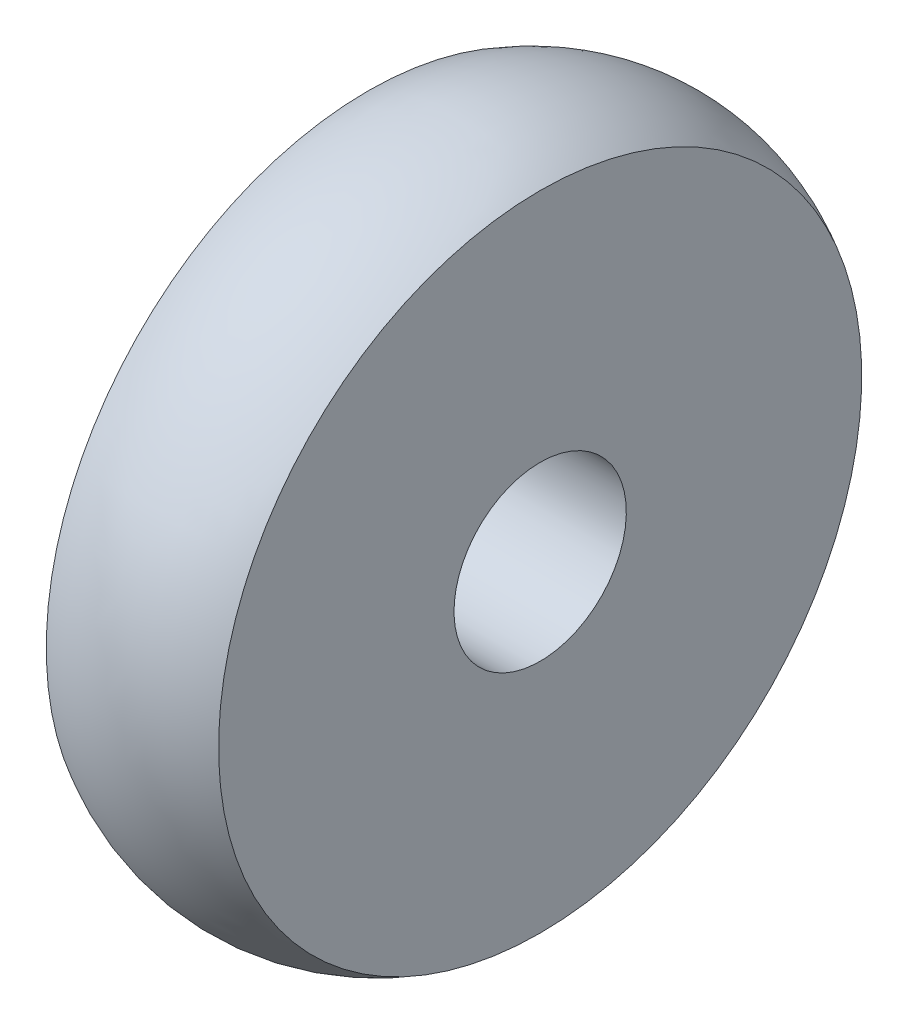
ISO-10303-21;
HEADER;
FILE_DESCRIPTION(('STEP AP214'),'2;1');
FILE_NAME('part.step','',(''),(''),'','','');
FILE_SCHEMA(('AUTOMOTIVE_DESIGN { 1 0 10303 214 1 1 1 1 }'));
ENDSEC;
DATA;
#1=APPLICATION_CONTEXT('core data for automotive mechanical design processes');
#2=APPLICATION_PROTOCOL_DEFINITION('international standard','automotive_design',2000,#1);
#3=PRODUCT_CONTEXT('',#1,'mechanical');
#4=PRODUCT('Part','Part','',(#3));
#5=PRODUCT_RELATED_PRODUCT_CATEGORY('part','',(#4));
#6=PRODUCT_DEFINITION_FORMATION('','',#4);
#7=PRODUCT_DEFINITION_CONTEXT('part definition',#1,'design');
#8=PRODUCT_DEFINITION('design','',#6,#7);
#9=PRODUCT_DEFINITION_SHAPE('','',#8);
#10=(LENGTH_UNIT() NAMED_UNIT(*) SI_UNIT(.MILLI.,.METRE.));
#11=(NAMED_UNIT(*) PLANE_ANGLE_UNIT() SI_UNIT($,.RADIAN.));
#12=(NAMED_UNIT(*) SI_UNIT($,.STERADIAN.) SOLID_ANGLE_UNIT());
#13=UNCERTAINTY_MEASURE_WITH_UNIT(LENGTH_MEASURE(1.E-05),#10,'distance_accuracy_value','');
#14=(GEOMETRIC_REPRESENTATION_CONTEXT(3) GLOBAL_UNCERTAINTY_ASSIGNED_CONTEXT((#13)) GLOBAL_UNIT_ASSIGNED_CONTEXT((#10,
#11,#12)) REPRESENTATION_CONTEXT('',''));
#15=CARTESIAN_POINT('',(0.,0.,0.));
#16=DIRECTION('',(0.,0.,1.));
#17=DIRECTION('',(1.,0.,0.));
#18=AXIS2_PLACEMENT_3D('',#15,#16,#17);
#19=CARTESIAN_POINT('',(3.,7.09807621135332,0.));
#20=DIRECTION('',(1.,0.,0.));
#21=DIRECTION('',(0.,1.,0.));
#22=AXIS2_PLACEMENT_3D('',#19,#20,#21);
#23=PLANE('',#22);
#24=CARTESIAN_POINT('',(3.,0.,0.));
#25=DIRECTION('',(1.,0.,0.));
#26=DIRECTION('',(0.,1.,0.));
#27=AXIS2_PLACEMENT_3D('',#24,#25,#26);
#28=CIRCLE('',#27,3.);
#29=CARTESIAN_POINT('',(3.,3.,0.));
#30=VERTEX_POINT('',#29);
#31=EDGE_CURVE('E54',#30,#30,#28,.T.);
#32=ORIENTED_EDGE('',*,*,#31,.F.);
#33=EDGE_LOOP('',(#32));
#34=FACE_BOUND('',#33,.T.);
#35=CARTESIAN_POINT('',(3.,0.,0.));
#36=DIRECTION('',(1.,0.,0.));
#37=DIRECTION('',(0.,1.,0.));
#38=AXIS2_PLACEMENT_3D('',#35,#36,#37);
#39=CIRCLE('',#38,11.1961524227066);
#40=CARTESIAN_POINT('',(3.,11.1961524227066,0.));
#41=VERTEX_POINT('',#40);
#42=EDGE_CURVE('E10',#41,#41,#39,.T.);
#43=ORIENTED_EDGE('',*,*,#42,.T.);
#44=EDGE_LOOP('',(#43));
#45=FACE_BOUND('',#44,.T.);
#46=ADVANCED_FACE('F16',(#34,#45),#23,.T.);
#47=CARTESIAN_POINT('',(0.,0.,0.));
#48=DIRECTION('',(1.,0.,0.));
#49=DIRECTION('',(0.,0.,-1.));
#50=AXIS2_PLACEMENT_3D('',#47,#48,#49);
#51=DEGENERATE_TOROIDAL_SURFACE('',#50,6.,6.,.T.);
#52=CARTESIAN_POINT('',(-3.,0.,0.));
#53=DIRECTION('',(1.,0.,0.));
#54=DIRECTION('',(0.,1.,0.));
#55=AXIS2_PLACEMENT_3D('',#52,#53,#54);
#56=CIRCLE('',#55,11.1961524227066);
#57=CARTESIAN_POINT('',(-3.,11.1961524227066,0.));
#58=VERTEX_POINT('',#57);
#59=EDGE_CURVE('E24',#58,#58,#56,.T.);
#60=ORIENTED_EDGE('',*,*,#59,.T.);
#61=EDGE_LOOP('',(#60));
#62=FACE_BOUND('',#61,.T.);
#63=ORIENTED_EDGE('',*,*,#42,.F.);
#64=EDGE_LOOP('',(#63));
#65=FACE_BOUND('',#64,.T.);
#66=ADVANCED_FACE('F101',(#62,#65),#51,.T.);
#67=CARTESIAN_POINT('',(-3.,7.09807621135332,0.));
#68=DIRECTION('',(-1.,0.,0.));
#69=DIRECTION('',(0.,0.,1.));
#70=AXIS2_PLACEMENT_3D('',#67,#68,#69);
#71=PLANE('',#70);
#72=CARTESIAN_POINT('',(-3.,0.,0.));
#73=DIRECTION('',(1.,0.,0.));
#74=DIRECTION('',(0.,1.,0.));
#75=AXIS2_PLACEMENT_3D('',#72,#73,#74);
#76=CIRCLE('',#75,3.);
#77=CARTESIAN_POINT('',(-3.,3.,0.));
#78=VERTEX_POINT('',#77);
#79=EDGE_CURVE('E49',#78,#78,#76,.T.);
#80=ORIENTED_EDGE('',*,*,#79,.T.);
#81=EDGE_LOOP('',(#80));
#82=FACE_BOUND('',#81,.T.);
#83=ORIENTED_EDGE('',*,*,#59,.F.);
#84=EDGE_LOOP('',(#83));
#85=FACE_BOUND('',#84,.T.);
#86=ADVANCED_FACE('F50',(#82,#85),#71,.T.);
#87=CARTESIAN_POINT('',(-1.5,0.,0.));
#88=DIRECTION('',(1.,0.,0.));
#89=DIRECTION('',(0.,1.,0.));
#90=AXIS2_PLACEMENT_3D('',#87,#88,#89);
#91=CYLINDRICAL_SURFACE('',#90,3.);
#92=ORIENTED_EDGE('',*,*,#31,.T.);
#93=EDGE_LOOP('',(#92));
#94=FACE_BOUND('',#93,.T.);
#95=ORIENTED_EDGE('',*,*,#79,.F.);
#96=EDGE_LOOP('',(#95));
#97=FACE_BOUND('',#96,.T.);
#98=ADVANCED_FACE('F84',(#94,#97),#91,.F.);
#99=CLOSED_SHELL('',(#46,#66,#86,#98));
#100=MANIFOLD_SOLID_BREP('B1',#99);
#101=ADVANCED_BREP_SHAPE_REPRESENTATION('',(#18,#100),#14);
#102=SHAPE_DEFINITION_REPRESENTATION(#9,#101);
ENDSEC;
END-ISO-10303-21;
